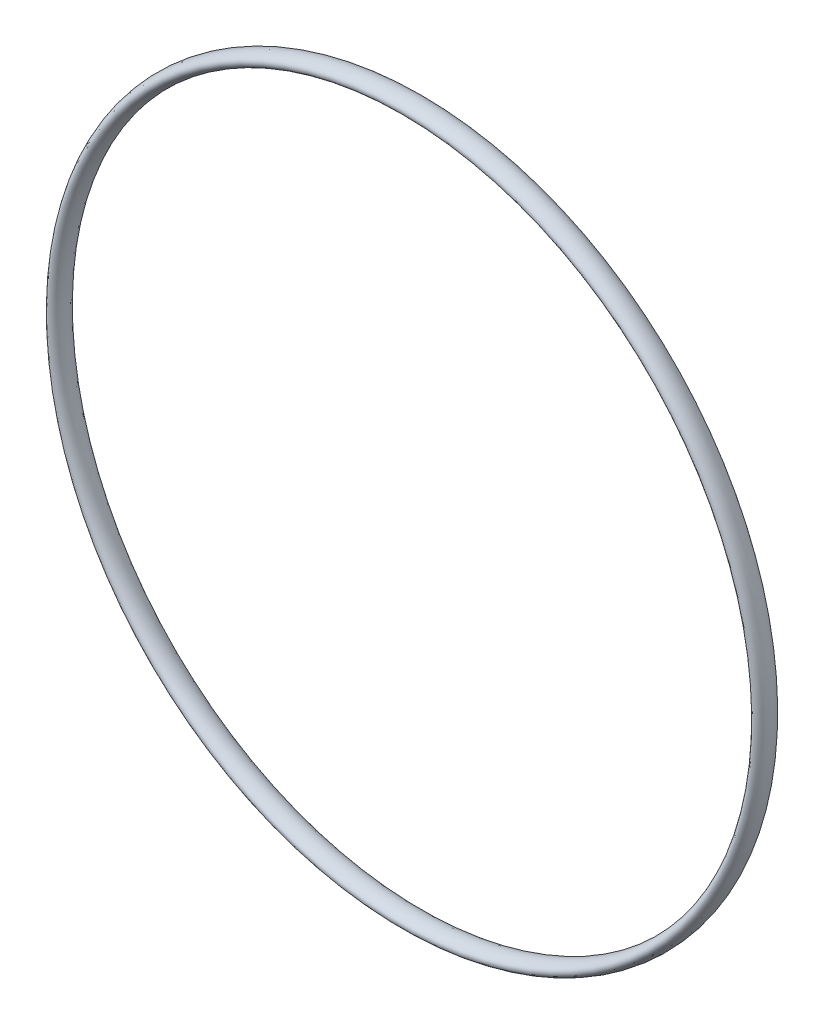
ISO-10303-21;
HEADER;
FILE_DESCRIPTION(('STEP AP214'),'2;1');
FILE_NAME('part.step','',(''),(''),'','','');
FILE_SCHEMA(('AUTOMOTIVE_DESIGN { 1 0 10303 214 1 1 1 1 }'));
ENDSEC;
DATA;
#1=APPLICATION_CONTEXT('core data for automotive mechanical design processes');
#2=APPLICATION_PROTOCOL_DEFINITION('international standard','automotive_design',2000,#1);
#3=PRODUCT_CONTEXT('',#1,'mechanical');
#4=PRODUCT('Part','Part','',(#3));
#5=PRODUCT_RELATED_PRODUCT_CATEGORY('part','',(#4));
#6=PRODUCT_DEFINITION_FORMATION('','',#4);
#7=PRODUCT_DEFINITION_CONTEXT('part definition',#1,'design');
#8=PRODUCT_DEFINITION('design','',#6,#7);
#9=PRODUCT_DEFINITION_SHAPE('','',#8);
#10=(LENGTH_UNIT() NAMED_UNIT(*) SI_UNIT(.MILLI.,.METRE.));
#11=(NAMED_UNIT(*) PLANE_ANGLE_UNIT() SI_UNIT($,.RADIAN.));
#12=(NAMED_UNIT(*) SI_UNIT($,.STERADIAN.) SOLID_ANGLE_UNIT());
#13=UNCERTAINTY_MEASURE_WITH_UNIT(LENGTH_MEASURE(1.E-05),#10,'distance_accuracy_value','');
#14=(GEOMETRIC_REPRESENTATION_CONTEXT(3) GLOBAL_UNCERTAINTY_ASSIGNED_CONTEXT((#13)) GLOBAL_UNIT_ASSIGNED_CONTEXT((#10,
#11,#12)) REPRESENTATION_CONTEXT('',''));
#15=CARTESIAN_POINT('',(0.,0.,0.));
#16=DIRECTION('',(0.,0.,1.));
#17=DIRECTION('',(1.,0.,0.));
#18=AXIS2_PLACEMENT_3D('',#15,#16,#17);
#19=CARTESIAN_POINT('',(0.,75.95,-2.4));
#20=DIRECTION('',(1.,0.,0.));
#21=DIRECTION('',(0.,0.,-1.));
#22=AXIS2_PLACEMENT_3D('',#19,#20,#21);
#23=ELLIPSE('',#22,2.4,1.45000000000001);
#24=CARTESIAN_POINT('',(0.,0.,0.));
#25=DIRECTION('',(0.,0.,1.));
#26=AXIS1_PLACEMENT('',#24,#25);
#27=SURFACE_OF_REVOLUTION('',#23,#26);
#28=ADVANCED_FACE('F28',(),#27,.T.);
#29=CLOSED_SHELL('',(#28));
#30=MANIFOLD_SOLID_BREP('B2',#29);
#31=ADVANCED_BREP_SHAPE_REPRESENTATION('',(#18,#30),#14);
#32=SHAPE_DEFINITION_REPRESENTATION(#9,#31);
ENDSEC;
END-ISO-10303-21;
